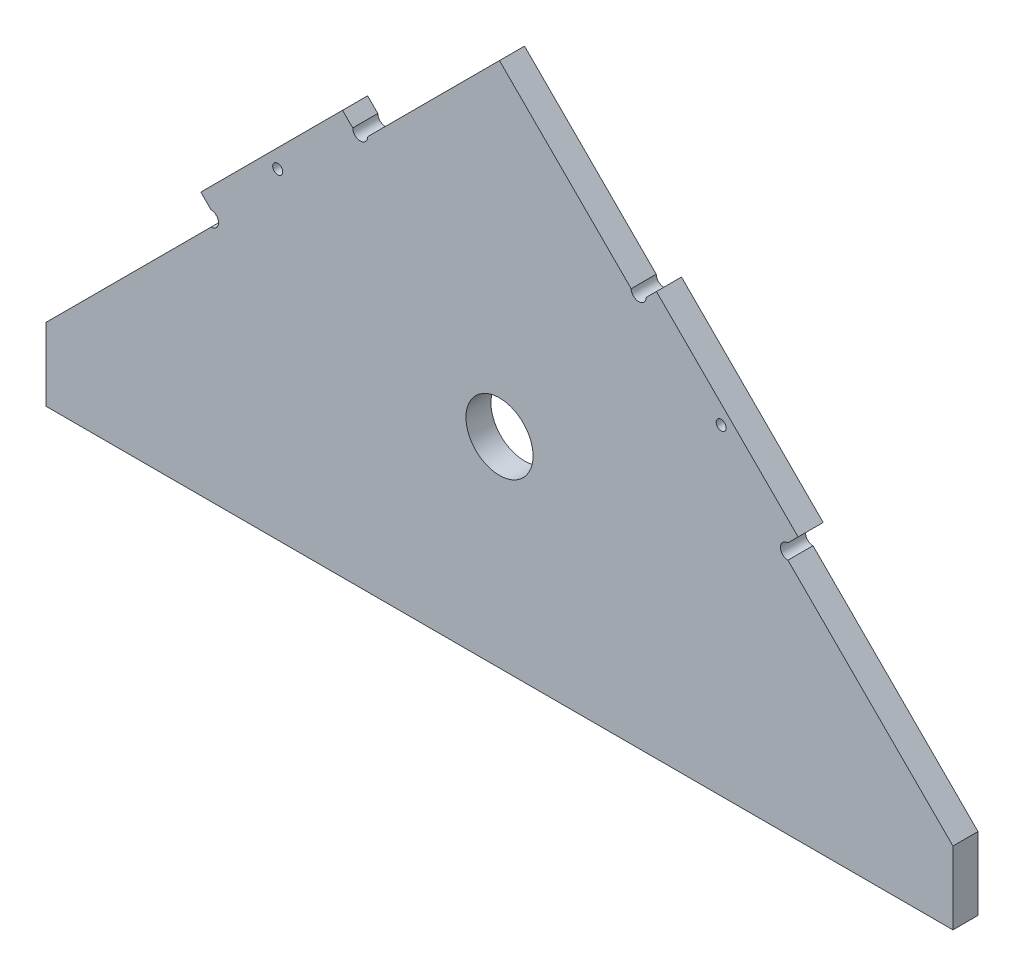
from build123d import *

# Parameters (mm, degrees)
ESQUISSE1_R             = 1
BOSS_EXTRU_1_DEPTH      = 5
ESQUISSE2_R             = 6.7
ENL_V_MAT_EXTRU_1_DEPTH = 10


with BuildPart() as part:
    # Esquisse1 → Boss.-Extru.1 (new body)
    with BuildSketch(Plane.XY):
        with BuildLine():
            Line((90.5, 0), (-90.5, 0))
            Line((-90.5, 0), (-90.5, 14.5))
            Line((-90.5, 14.5), (-57.568542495, 47.431457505))
            ThreePointArc((-57.568542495, 47.431457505), (-56.068542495, 48.931457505), (-57.568542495, 50.431457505))
            Line((-57.568542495, 50.431457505), (-59.604076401, 52.466991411))
            Line((-59.604076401, 52.466991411), (-31.319805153, 80.751262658))
            Line((-31.319805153, 80.751262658), (-29.284271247, 78.715728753))
            ThreePointArc((-29.284271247, 78.715728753), (-27.784271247, 77.215728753), (-26.284271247, 78.715728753))
            Line((-26.284271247, 78.715728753), (0, 105))
            Line((0, 105), (26.284271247, 78.715728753))
            ThreePointArc((26.284271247, 78.715728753), (27.784271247, 77.215728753), (29.284271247, 78.715728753))
            Line((29.284271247, 78.715728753), (31.319805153, 80.751262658))
            Line((31.319805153, 80.751262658), (59.604076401, 52.466991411))
            Line((59.604076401, 52.466991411), (57.568542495, 50.431457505))
            ThreePointArc((57.568542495, 50.431457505), (56.068542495, 48.931457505), (57.568542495, 47.431457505))
            Line((57.568542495, 47.431457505), (90.5, 14.5))
            Line((90.5, 14.5), (90.5, 0))
        make_face()
        with Locations(Location((-44.253393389, 64.122363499, 0), (0, 0, 180))):
            Circle(ESQUISSE1_R, mode=Mode.SUBTRACT)
        with Locations((44.253393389, 64.122363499)):
            Circle(ESQUISSE1_R, mode=Mode.SUBTRACT)
    extrude(amount=BOSS_EXTRU_1_DEPTH)

    # Esquisse2 → Enl_v. mat.-Extru.1 (cut)
    with BuildSketch(Plane.XY.offset(5)):
        with Locations((0, 40)):
            Circle(ESQUISSE2_R)
    extrude(amount=-ENL_V_MAT_EXTRU_1_DEPTH, mode=Mode.SUBTRACT)


solid = part.part
